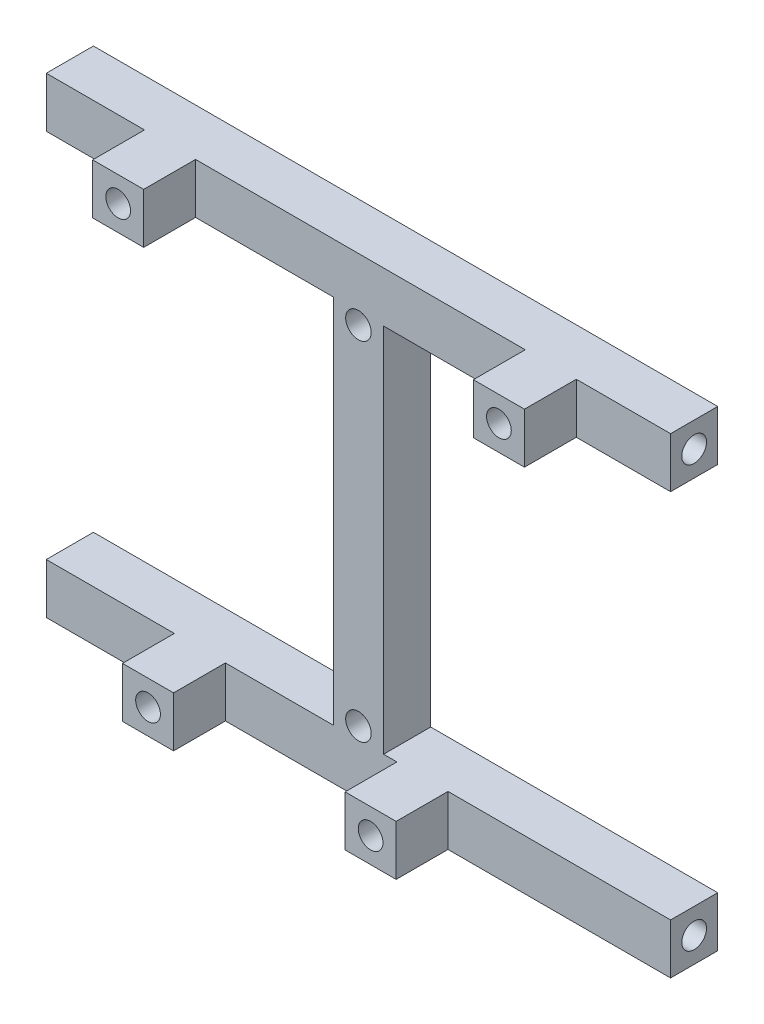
from build123d import *

# Parameters (mm, degrees)
BOSS_EXTRUDE2_DEPTH = 6
SKETCH2_W           = 6.5
SKETCH2_H           = 6.4
BOSS_EXTRUDE3_DEPTH = 6.6
CUT_EXTRUDE1_DEPTH  = 6.6
CUT_EXTRUDE2_DEPTH  = 51.219845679
CUT_EXTRUDE3_DEPTH  = 11
CUT_EXTRUDE4_START  = -11
CUT_EXTRUDE4_DEPTH  = 11


with BuildPart() as part:
    # Sketch1 → Boss-Extrude2 (new body)
    with BuildSketch(Plane.XY):
        Polygon((-39.73, -30), (39.73, -30), (39.73, -23.6), (3.2, -23.6), (3.2, 23.6), (39.73, 23.6), (39.73, 30), (-39.73, 30), (-39.73, 23.6), (-3.2, 23.6), (-3.2, -23.6), (-39.73, -23.6), align=None)
    extrude(amount=BOSS_EXTRUDE2_DEPTH)

    # Sketch2 → Boss-Extrude3 (add)
    with BuildSketch(Plane.XY.offset(6)):
        with Locations((24.48, 26.8)):
            Rectangle(SKETCH2_W, SKETCH2_H)
        with Locations((-23.98, 26.8)):
            Rectangle(SKETCH2_W, SKETCH2_H)
        with Locations((-20.18, -26.8)):
            Rectangle(SKETCH2_W, SKETCH2_H)
        with Locations((8.15, -26.8)):
            Rectangle(SKETCH2_W, SKETCH2_H)
    extrude(amount=BOSS_EXTRUDE3_DEPTH)

    # Sketch3 → Cut-Extrude1 (cut)
    with BuildSketch(Plane.XY.offset(12.6)):
        with BuildLine():
            ThreePointArc((-19.057707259, -25.694973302), (-20.18, -25.225), (-21.302292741, -25.694973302))
            Line((-21.302292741, -25.694973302), (-20.18, -26.8))
            Line((-20.18, -26.8), (-19.057707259, -25.694973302))
        make_face()
        with BuildLine():
            Line((-20.18, -26.8), (-21.302292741, -25.694973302))
            ThreePointArc((-21.302292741, -25.694973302), (-21.755, -26.8), (-21.302292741, -27.905026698))
            Line((-21.302292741, -27.905026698), (-20.18, -26.8))
        make_face()
        with BuildLine():
            Line((-19.057707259, -25.694973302), (-20.18, -26.8))
            Line((-20.18, -26.8), (-19.057707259, -27.905026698))
            ThreePointArc((-19.057707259, -27.905026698), (-18.72256457, -27.397082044), (-18.605, -26.8))
            ThreePointArc((-18.605, -26.8), (-18.72256457, -26.202917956), (-19.057707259, -25.694973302))
        make_face()
        with BuildLine():
            Line((-19.057707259, -27.905026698), (-20.18, -26.8))
            Line((-20.18, -26.8), (-21.302292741, -27.905026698))
            ThreePointArc((-21.302292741, -27.905026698), (-20.18, -28.375), (-19.057707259, -27.905026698))
        make_face()
        with BuildLine():
            ThreePointArc((-19.057707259, -25.694973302), (-20.18, -25.225), (-21.302292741, -25.694973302))
            Line((-21.302292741, -25.694973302), (-20.18, -26.8))
            Line((-20.18, -26.8), (-19.057707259, -25.694973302))
        make_face()
        with BuildLine():
            Line((-20.18, -26.8), (-21.302292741, -25.694973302))
            ThreePointArc((-21.302292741, -25.694973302), (-21.755, -26.8), (-21.302292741, -27.905026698))
            Line((-21.302292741, -27.905026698), (-20.18, -26.8))
        make_face()
        with BuildLine():
            Line((-19.057707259, -25.694973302), (-20.18, -26.8))
            Line((-20.18, -26.8), (-19.057707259, -27.905026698))
            ThreePointArc((-19.057707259, -27.905026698), (-18.72256457, -27.397082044), (-18.605, -26.8))
            ThreePointArc((-18.605, -26.8), (-18.72256457, -26.202917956), (-19.057707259, -25.694973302))
        make_face()
        with BuildLine():
            Line((-19.057707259, -27.905026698), (-20.18, -26.8))
            Line((-20.18, -26.8), (-21.302292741, -27.905026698))
            ThreePointArc((-21.302292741, -27.905026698), (-20.18, -28.375), (-19.057707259, -27.905026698))
        make_face()
        with BuildLine():
            ThreePointArc((-19.057707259, -25.694973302), (-20.18, -25.225), (-21.302292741, -25.694973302))
            Line((-21.302292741, -25.694973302), (-20.18, -26.8))
            Line((-20.18, -26.8), (-19.057707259, -25.694973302))
        make_face()
        with BuildLine():
            Line((-20.18, -26.8), (-21.302292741, -25.694973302))
            ThreePointArc((-21.302292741, -25.694973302), (-21.755, -26.8), (-21.302292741, -27.905026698))
            Line((-21.302292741, -27.905026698), (-20.18, -26.8))
        make_face()
        with BuildLine():
            Line((-19.057707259, -25.694973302), (-20.18, -26.8))
            Line((-20.18, -26.8), (-19.057707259, -27.905026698))
            ThreePointArc((-19.057707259, -27.905026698), (-18.72256457, -27.397082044), (-18.605, -26.8))
            ThreePointArc((-18.605, -26.8), (-18.72256457, -26.202917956), (-19.057707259, -25.694973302))
        make_face()
        with BuildLine():
            Line((-19.057707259, -27.905026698), (-20.18, -26.8))
            Line((-20.18, -26.8), (-21.302292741, -27.905026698))
            ThreePointArc((-21.302292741, -27.905026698), (-20.18, -28.375), (-19.057707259, -27.905026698))
        make_face()
        with BuildLine():
            ThreePointArc((-19.057707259, -25.694973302), (-20.18, -25.225), (-21.302292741, -25.694973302))
            Line((-21.302292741, -25.694973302), (-20.18, -26.8))
            Line((-20.18, -26.8), (-19.057707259, -25.694973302))
        make_face()
        with BuildLine():
            Line((-20.18, -26.8), (-21.302292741, -25.694973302))
            ThreePointArc((-21.302292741, -25.694973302), (-21.755, -26.8), (-21.302292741, -27.905026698))
            Line((-21.302292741, -27.905026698), (-20.18, -26.8))
        make_face()
        with BuildLine():
            Line((-19.057707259, -25.694973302), (-20.18, -26.8))
            Line((-20.18, -26.8), (-19.057707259, -27.905026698))
            ThreePointArc((-19.057707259, -27.905026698), (-18.72256457, -27.397082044), (-18.605, -26.8))
            ThreePointArc((-18.605, -26.8), (-18.72256457, -26.202917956), (-19.057707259, -25.694973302))
        make_face()
        with BuildLine():
            Line((-19.057707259, -27.905026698), (-20.18, -26.8))
            Line((-20.18, -26.8), (-21.302292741, -27.905026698))
            ThreePointArc((-21.302292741, -27.905026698), (-20.18, -28.375), (-19.057707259, -27.905026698))
        make_face()
        with BuildLine():
            ThreePointArc((9.272292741, -25.694973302), (8.15, -25.225), (7.027707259, -25.694973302))
            Line((7.027707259, -25.694973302), (8.15, -26.8))
            Line((8.15, -26.8), (9.272292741, -25.694973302))
        make_face()
        with BuildLine():
            Line((8.15, -26.8), (7.027707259, -25.694973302))
            ThreePointArc((7.027707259, -25.694973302), (6.575, -26.8), (7.027707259, -27.905026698))
            Line((7.027707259, -27.905026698), (8.15, -26.8))
        make_face()
        with BuildLine():
            Line((9.272292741, -25.694973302), (8.15, -26.8))
            Line((8.15, -26.8), (9.272292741, -27.905026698))
            ThreePointArc((9.272292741, -27.905026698), (9.60743543, -27.397082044), (9.725, -26.8))
            ThreePointArc((9.725, -26.8), (9.60743543, -26.202917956), (9.272292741, -25.694973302))
        make_face()
        with BuildLine():
            Line((9.272292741, -27.905026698), (8.15, -26.8))
            Line((8.15, -26.8), (7.027707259, -27.905026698))
            ThreePointArc((7.027707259, -27.905026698), (8.15, -28.375), (9.272292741, -27.905026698))
        make_face()
        with BuildLine():
            ThreePointArc((9.272292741, -25.694973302), (8.15, -25.225), (7.027707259, -25.694973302))
            Line((7.027707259, -25.694973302), (8.15, -26.8))
            Line((8.15, -26.8), (9.272292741, -25.694973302))
        make_face()
        with BuildLine():
            Line((8.15, -26.8), (7.027707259, -25.694973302))
            ThreePointArc((7.027707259, -25.694973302), (6.575, -26.8), (7.027707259, -27.905026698))
            Line((7.027707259, -27.905026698), (8.15, -26.8))
        make_face()
        with BuildLine():
            Line((9.272292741, -25.694973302), (8.15, -26.8))
            Line((8.15, -26.8), (9.272292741, -27.905026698))
            ThreePointArc((9.272292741, -27.905026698), (9.60743543, -27.397082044), (9.725, -26.8))
            ThreePointArc((9.725, -26.8), (9.60743543, -26.202917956), (9.272292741, -25.694973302))
        make_face()
        with BuildLine():
            Line((9.272292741, -27.905026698), (8.15, -26.8))
            Line((8.15, -26.8), (7.027707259, -27.905026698))
            ThreePointArc((7.027707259, -27.905026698), (8.15, -28.375), (9.272292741, -27.905026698))
        make_face()
        with BuildLine():
            ThreePointArc((9.272292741, -25.694973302), (8.15, -25.225), (7.027707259, -25.694973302))
            Line((7.027707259, -25.694973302), (8.15, -26.8))
            Line((8.15, -26.8), (9.272292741, -25.694973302))
        make_face()
        with BuildLine():
            Line((8.15, -26.8), (7.027707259, -25.694973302))
            ThreePointArc((7.027707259, -25.694973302), (6.575, -26.8), (7.027707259, -27.905026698))
            Line((7.027707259, -27.905026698), (8.15, -26.8))
        make_face()
        with BuildLine():
            Line((9.272292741, -25.694973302), (8.15, -26.8))
            Line((8.15, -26.8), (9.272292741, -27.905026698))
            ThreePointArc((9.272292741, -27.905026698), (9.60743543, -27.397082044), (9.725, -26.8))
            ThreePointArc((9.725, -26.8), (9.60743543, -26.202917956), (9.272292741, -25.694973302))
        make_face()
        with BuildLine():
            Line((9.272292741, -27.905026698), (8.15, -26.8))
            Line((8.15, -26.8), (7.027707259, -27.905026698))
            ThreePointArc((7.027707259, -27.905026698), (8.15, -28.375), (9.272292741, -27.905026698))
        make_face()
        with BuildLine():
            ThreePointArc((9.272292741, -25.694973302), (8.15, -25.225), (7.027707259, -25.694973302))
            Line((7.027707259, -25.694973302), (8.15, -26.8))
            Line((8.15, -26.8), (9.272292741, -25.694973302))
        make_face()
        with BuildLine():
            Line((8.15, -26.8), (7.027707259, -25.694973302))
            ThreePointArc((7.027707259, -25.694973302), (6.575, -26.8), (7.027707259, -27.905026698))
            Line((7.027707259, -27.905026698), (8.15, -26.8))
        make_face()
        with BuildLine():
            Line((9.272292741, -25.694973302), (8.15, -26.8))
            Line((8.15, -26.8), (9.272292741, -27.905026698))
            ThreePointArc((9.272292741, -27.905026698), (9.60743543, -27.397082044), (9.725, -26.8))
            ThreePointArc((9.725, -26.8), (9.60743543, -26.202917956), (9.272292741, -25.694973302))
        make_face()
        with BuildLine():
            Line((9.272292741, -27.905026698), (8.15, -26.8))
            Line((8.15, -26.8), (7.027707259, -27.905026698))
            ThreePointArc((7.027707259, -27.905026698), (8.15, -28.375), (9.272292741, -27.905026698))
        make_face()
        with BuildLine():
            ThreePointArc((-22.857707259, 27.905026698), (-23.98, 28.375), (-25.102292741, 27.905026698))
            Line((-25.102292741, 27.905026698), (-23.98, 26.8))
            Line((-23.98, 26.8), (-22.857707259, 27.905026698))
        make_face()
        with BuildLine():
            Line((-23.98, 26.8), (-25.102292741, 27.905026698))
            ThreePointArc((-25.102292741, 27.905026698), (-25.555, 26.8), (-25.102292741, 25.694973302))
            Line((-25.102292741, 25.694973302), (-23.98, 26.8))
        make_face()
        with BuildLine():
            Line((-22.857707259, 27.905026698), (-23.98, 26.8))
            Line((-23.98, 26.8), (-22.857707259, 25.694973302))
            ThreePointArc((-22.857707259, 25.694973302), (-22.52256457, 26.202917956), (-22.405, 26.8))
            ThreePointArc((-22.405, 26.8), (-22.52256457, 27.397082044), (-22.857707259, 27.905026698))
        make_face()
        with BuildLine():
            Line((-22.857707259, 25.694973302), (-23.98, 26.8))
            Line((-23.98, 26.8), (-25.102292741, 25.694973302))
            ThreePointArc((-25.102292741, 25.694973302), (-23.98, 25.225), (-22.857707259, 25.694973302))
        make_face()
        with BuildLine():
            ThreePointArc((-22.857707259, 27.905026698), (-23.98, 28.375), (-25.102292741, 27.905026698))
            Line((-25.102292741, 27.905026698), (-23.98, 26.8))
            Line((-23.98, 26.8), (-22.857707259, 27.905026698))
        make_face()
        with BuildLine():
            Line((-23.98, 26.8), (-25.102292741, 27.905026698))
            ThreePointArc((-25.102292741, 27.905026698), (-25.555, 26.8), (-25.102292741, 25.694973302))
            Line((-25.102292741, 25.694973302), (-23.98, 26.8))
        make_face()
        with BuildLine():
            Line((-22.857707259, 27.905026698), (-23.98, 26.8))
            Line((-23.98, 26.8), (-22.857707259, 25.694973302))
            ThreePointArc((-22.857707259, 25.694973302), (-22.52256457, 26.202917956), (-22.405, 26.8))
            ThreePointArc((-22.405, 26.8), (-22.52256457, 27.397082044), (-22.857707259, 27.905026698))
        make_face()
        with BuildLine():
            Line((-22.857707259, 25.694973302), (-23.98, 26.8))
            Line((-23.98, 26.8), (-25.102292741, 25.694973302))
            ThreePointArc((-25.102292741, 25.694973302), (-23.98, 25.225), (-22.857707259, 25.694973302))
        make_face()
        with BuildLine():
            ThreePointArc((-22.857707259, 27.905026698), (-23.98, 28.375), (-25.102292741, 27.905026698))
            Line((-25.102292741, 27.905026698), (-23.98, 26.8))
            Line((-23.98, 26.8), (-22.857707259, 27.905026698))
        make_face()
        with BuildLine():
            Line((-23.98, 26.8), (-25.102292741, 27.905026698))
            ThreePointArc((-25.102292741, 27.905026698), (-25.555, 26.8), (-25.102292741, 25.694973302))
            Line((-25.102292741, 25.694973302), (-23.98, 26.8))
        make_face()
        with BuildLine():
            Line((-22.857707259, 27.905026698), (-23.98, 26.8))
            Line((-23.98, 26.8), (-22.857707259, 25.694973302))
            ThreePointArc((-22.857707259, 25.694973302), (-22.52256457, 26.202917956), (-22.405, 26.8))
            ThreePointArc((-22.405, 26.8), (-22.52256457, 27.397082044), (-22.857707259, 27.905026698))
        make_face()
        with BuildLine():
            Line((-22.857707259, 25.694973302), (-23.98, 26.8))
            Line((-23.98, 26.8), (-25.102292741, 25.694973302))
            ThreePointArc((-25.102292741, 25.694973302), (-23.98, 25.225), (-22.857707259, 25.694973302))
        make_face()
        with BuildLine():
            ThreePointArc((-22.857707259, 27.905026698), (-23.98, 28.375), (-25.102292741, 27.905026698))
            Line((-25.102292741, 27.905026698), (-23.98, 26.8))
            Line((-23.98, 26.8), (-22.857707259, 27.905026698))
        make_face()
        with BuildLine():
            Line((-23.98, 26.8), (-25.102292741, 27.905026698))
            ThreePointArc((-25.102292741, 27.905026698), (-25.555, 26.8), (-25.102292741, 25.694973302))
            Line((-25.102292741, 25.694973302), (-23.98, 26.8))
        make_face()
        with BuildLine():
            Line((-22.857707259, 27.905026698), (-23.98, 26.8))
            Line((-23.98, 26.8), (-22.857707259, 25.694973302))
            ThreePointArc((-22.857707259, 25.694973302), (-22.52256457, 26.202917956), (-22.405, 26.8))
            ThreePointArc((-22.405, 26.8), (-22.52256457, 27.397082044), (-22.857707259, 27.905026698))
        make_face()
        with BuildLine():
            Line((-22.857707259, 25.694973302), (-23.98, 26.8))
            Line((-23.98, 26.8), (-25.102292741, 25.694973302))
            ThreePointArc((-25.102292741, 25.694973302), (-23.98, 25.225), (-22.857707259, 25.694973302))
        make_face()
        with BuildLine():
            ThreePointArc((23.357707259, 27.905026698), (22.905, 26.8), (23.357707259, 25.694973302))
            Line((23.357707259, 25.694973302), (24.48, 26.8))
            Line((24.48, 26.8), (23.357707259, 27.905026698))
        make_face()
        with BuildLine():
            Line((24.48, 26.8), (23.357707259, 25.694973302))
            ThreePointArc((23.357707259, 25.694973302), (24.48, 25.225), (25.602292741, 25.694973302))
            Line((25.602292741, 25.694973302), (24.48, 26.8))
        make_face()
        with BuildLine():
            Line((23.357707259, 27.905026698), (24.48, 26.8))
            Line((24.48, 26.8), (25.602292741, 27.905026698))
            ThreePointArc((25.602292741, 27.905026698), (24.48, 28.375), (23.357707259, 27.905026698))
        make_face()
        with BuildLine():
            Line((25.602292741, 27.905026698), (24.48, 26.8))
            Line((24.48, 26.8), (25.602292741, 25.694973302))
            ThreePointArc((25.602292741, 25.694973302), (25.93743543, 26.202917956), (26.055, 26.8))
            ThreePointArc((26.055, 26.8), (25.93743543, 27.397082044), (25.602292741, 27.905026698))
        make_face()
        with BuildLine():
            ThreePointArc((23.357707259, 27.905026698), (22.905, 26.8), (23.357707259, 25.694973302))
            Line((23.357707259, 25.694973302), (24.48, 26.8))
            Line((24.48, 26.8), (23.357707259, 27.905026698))
        make_face()
        with BuildLine():
            Line((24.48, 26.8), (23.357707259, 25.694973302))
            ThreePointArc((23.357707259, 25.694973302), (24.48, 25.225), (25.602292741, 25.694973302))
            Line((25.602292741, 25.694973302), (24.48, 26.8))
        make_face()
        with BuildLine():
            Line((23.357707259, 27.905026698), (24.48, 26.8))
            Line((24.48, 26.8), (25.602292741, 27.905026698))
            ThreePointArc((25.602292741, 27.905026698), (24.48, 28.375), (23.357707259, 27.905026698))
        make_face()
        with BuildLine():
            Line((25.602292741, 27.905026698), (24.48, 26.8))
            Line((24.48, 26.8), (25.602292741, 25.694973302))
            ThreePointArc((25.602292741, 25.694973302), (25.93743543, 26.202917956), (26.055, 26.8))
            ThreePointArc((26.055, 26.8), (25.93743543, 27.397082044), (25.602292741, 27.905026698))
        make_face()
        with BuildLine():
            ThreePointArc((23.357707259, 27.905026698), (22.905, 26.8), (23.357707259, 25.694973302))
            Line((23.357707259, 25.694973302), (24.48, 26.8))
            Line((24.48, 26.8), (23.357707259, 27.905026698))
        make_face()
        with BuildLine():
            Line((24.48, 26.8), (23.357707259, 25.694973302))
            ThreePointArc((23.357707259, 25.694973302), (24.48, 25.225), (25.602292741, 25.694973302))
            Line((25.602292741, 25.694973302), (24.48, 26.8))
        make_face()
        with BuildLine():
            Line((23.357707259, 27.905026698), (24.48, 26.8))
            Line((24.48, 26.8), (25.602292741, 27.905026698))
            ThreePointArc((25.602292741, 27.905026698), (24.48, 28.375), (23.357707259, 27.905026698))
        make_face()
        with BuildLine():
            Line((25.602292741, 27.905026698), (24.48, 26.8))
            Line((24.48, 26.8), (25.602292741, 25.694973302))
            ThreePointArc((25.602292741, 25.694973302), (25.93743543, 26.202917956), (26.055, 26.8))
            ThreePointArc((26.055, 26.8), (25.93743543, 27.397082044), (25.602292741, 27.905026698))
        make_face()
        with BuildLine():
            ThreePointArc((23.357707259, 27.905026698), (22.905, 26.8), (23.357707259, 25.694973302))
            Line((23.357707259, 25.694973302), (24.48, 26.8))
            Line((24.48, 26.8), (23.357707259, 27.905026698))
        make_face()
        with BuildLine():
            Line((24.48, 26.8), (23.357707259, 25.694973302))
            ThreePointArc((23.357707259, 25.694973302), (24.48, 25.225), (25.602292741, 25.694973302))
            Line((25.602292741, 25.694973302), (24.48, 26.8))
        make_face()
        with BuildLine():
            Line((23.357707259, 27.905026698), (24.48, 26.8))
            Line((24.48, 26.8), (25.602292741, 27.905026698))
            ThreePointArc((25.602292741, 27.905026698), (24.48, 28.375), (23.357707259, 27.905026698))
        make_face()
        with BuildLine():
            Line((25.602292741, 27.905026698), (24.48, 26.8))
            Line((24.48, 26.8), (25.602292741, 25.694973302))
            ThreePointArc((25.602292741, 25.694973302), (25.93743543, 26.202917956), (26.055, 26.8))
            ThreePointArc((26.055, 26.8), (25.93743543, 27.397082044), (25.602292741, 27.905026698))
        make_face()
    extrude(amount=-CUT_EXTRUDE1_DEPTH, mode=Mode.SUBTRACT)

    # Sketch4 → Cut-Extrude2 (cut, through all)
    with BuildSketch(Plane.XY.offset(6)):
        with BuildLine():
            ThreePointArc((1.625, 22.1), (0, 23.725), (-1.625, 22.1))
            Line((-1.625, 22.1), (1.625, 22.1))
        make_face()
        with BuildLine():
            Line((1.625, 22.1), (-1.625, 22.1))
            ThreePointArc((-1.625, 22.1), (0, 20.475), (1.625, 22.1))
        make_face()
        with BuildLine():
            ThreePointArc((1.625, 22.1), (0, 23.725), (-1.625, 22.1))
            Line((-1.625, 22.1), (1.625, 22.1))
        make_face()
        with BuildLine():
            Line((1.625, 22.1), (-1.625, 22.1))
            ThreePointArc((-1.625, 22.1), (0, 20.475), (1.625, 22.1))
        make_face()
        with BuildLine():
            ThreePointArc((1.625, -22.1), (0, -20.475), (-1.625, -22.1))
            Line((-1.625, -22.1), (1.625, -22.1))
        make_face()
        with BuildLine():
            Line((1.625, -22.1), (-1.625, -22.1))
            ThreePointArc((-1.625, -22.1), (0, -23.725), (1.625, -22.1))
        make_face()
        with BuildLine():
            ThreePointArc((1.625, -22.1), (0, -20.475), (-1.625, -22.1))
            Line((-1.625, -22.1), (1.625, -22.1))
        make_face()
        with BuildLine():
            Line((1.625, -22.1), (-1.625, -22.1))
            ThreePointArc((-1.625, -22.1), (0, -23.725), (1.625, -22.1))
        make_face()
    extrude(amount=-CUT_EXTRUDE2_DEPTH, mode=Mode.SUBTRACT)

    # Sketch5 → Cut-Extrude3 (cut)
    with BuildSketch(Plane(origin=(39.73, 0, 0), x_dir=(0, 0, -1), z_dir=(1, 0, 0))):
        with BuildLine():
            ThreePointArc((-1.922792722, -25.650978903), (-4.149021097, -25.722792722), (-4.077207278, -27.949021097))
            Line((-4.077207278, -27.949021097), (-1.922792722, -25.650978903))
        make_face()
        with BuildLine():
            Line((-1.922792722, -25.650978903), (-4.077207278, -27.949021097))
            ThreePointArc((-4.077207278, -27.949021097), (-2.373891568, -28.245203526), (-1.425, -26.8))
            ThreePointArc((-1.425, -26.8), (-1.554796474, -26.173891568), (-1.922792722, -25.650978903))
        make_face()
        with BuildLine():
            ThreePointArc((-1.922792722, -25.650978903), (-4.149021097, -25.722792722), (-4.077207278, -27.949021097))
            Line((-4.077207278, -27.949021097), (-1.922792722, -25.650978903))
        make_face()
        with BuildLine():
            Line((-1.922792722, -25.650978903), (-4.077207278, -27.949021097))
            ThreePointArc((-4.077207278, -27.949021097), (-2.373891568, -28.245203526), (-1.425, -26.8))
            ThreePointArc((-1.425, -26.8), (-1.554796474, -26.173891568), (-1.922792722, -25.650978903))
        make_face()
        with BuildLine():
            ThreePointArc((-1.922792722, 27.949021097), (-4.149021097, 27.877207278), (-4.077207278, 25.650978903))
            Line((-4.077207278, 25.650978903), (-1.922792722, 27.949021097))
        make_face()
        with BuildLine():
            Line((-1.922792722, 27.949021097), (-4.077207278, 25.650978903))
            ThreePointArc((-4.077207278, 25.650978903), (-2.373891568, 25.354796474), (-1.425, 26.8))
            ThreePointArc((-1.425, 26.8), (-1.554796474, 27.426108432), (-1.922792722, 27.949021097))
        make_face()
        with BuildLine():
            ThreePointArc((-1.922792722, 27.949021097), (-4.149021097, 27.877207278), (-4.077207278, 25.650978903))
            Line((-4.077207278, 25.650978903), (-1.922792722, 27.949021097))
        make_face()
        with BuildLine():
            Line((-1.922792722, 27.949021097), (-4.077207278, 25.650978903))
            ThreePointArc((-4.077207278, 25.650978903), (-2.373891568, 25.354796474), (-1.425, 26.8))
            ThreePointArc((-1.425, 26.8), (-1.554796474, 27.426108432), (-1.922792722, 27.949021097))
        make_face()
    extrude(amount=-CUT_EXTRUDE3_DEPTH, mode=Mode.SUBTRACT)

    # Sketch6 → Cut-Extrude4 (cut)
    with BuildSketch(Plane.ZY.offset(39.73).offset(CUT_EXTRUDE4_START)):
        with BuildLine():
            ThreePointArc((4.575, 26.8), (3.626108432, 28.245203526), (1.922792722, 27.949021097))
            Line((1.922792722, 27.949021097), (4.077207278, 25.650978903))
            ThreePointArc((4.077207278, 25.650978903), (4.445203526, 26.173891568), (4.575, 26.8))
        make_face()
        with BuildLine():
            Line((4.077207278, 25.650978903), (1.922792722, 27.949021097))
            ThreePointArc((1.922792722, 27.949021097), (1.850978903, 25.722792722), (4.077207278, 25.650978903))
        make_face()
        with BuildLine():
            ThreePointArc((4.575, 26.8), (3.626108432, 28.245203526), (1.922792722, 27.949021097))
            Line((1.922792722, 27.949021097), (4.077207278, 25.650978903))
            ThreePointArc((4.077207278, 25.650978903), (4.445203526, 26.173891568), (4.575, 26.8))
        make_face()
        with BuildLine():
            Line((4.077207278, 25.650978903), (1.922792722, 27.949021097))
            ThreePointArc((1.922792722, 27.949021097), (1.850978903, 25.722792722), (4.077207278, 25.650978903))
        make_face()
        with BuildLine():
            ThreePointArc((4.575, -26.8), (3.626108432, -25.354796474), (1.922792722, -25.650978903))
            Line((1.922792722, -25.650978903), (4.077207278, -27.949021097))
            ThreePointArc((4.077207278, -27.949021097), (4.445203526, -27.426108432), (4.575, -26.8))
        make_face()
        with BuildLine():
            Line((4.077207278, -27.949021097), (1.922792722, -25.650978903))
            ThreePointArc((1.922792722, -25.650978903), (1.850978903, -27.877207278), (4.077207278, -27.949021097))
        make_face()
        with BuildLine():
            ThreePointArc((4.575, -26.8), (3.626108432, -25.354796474), (1.922792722, -25.650978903))
            Line((1.922792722, -25.650978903), (4.077207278, -27.949021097))
            ThreePointArc((4.077207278, -27.949021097), (4.445203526, -27.426108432), (4.575, -26.8))
        make_face()
        with BuildLine():
            Line((4.077207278, -27.949021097), (1.922792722, -25.650978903))
            ThreePointArc((1.922792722, -25.650978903), (1.850978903, -27.877207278), (4.077207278, -27.949021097))
        make_face()
    extrude(amount=CUT_EXTRUDE4_DEPTH, mode=Mode.SUBTRACT)


solid = part.part
